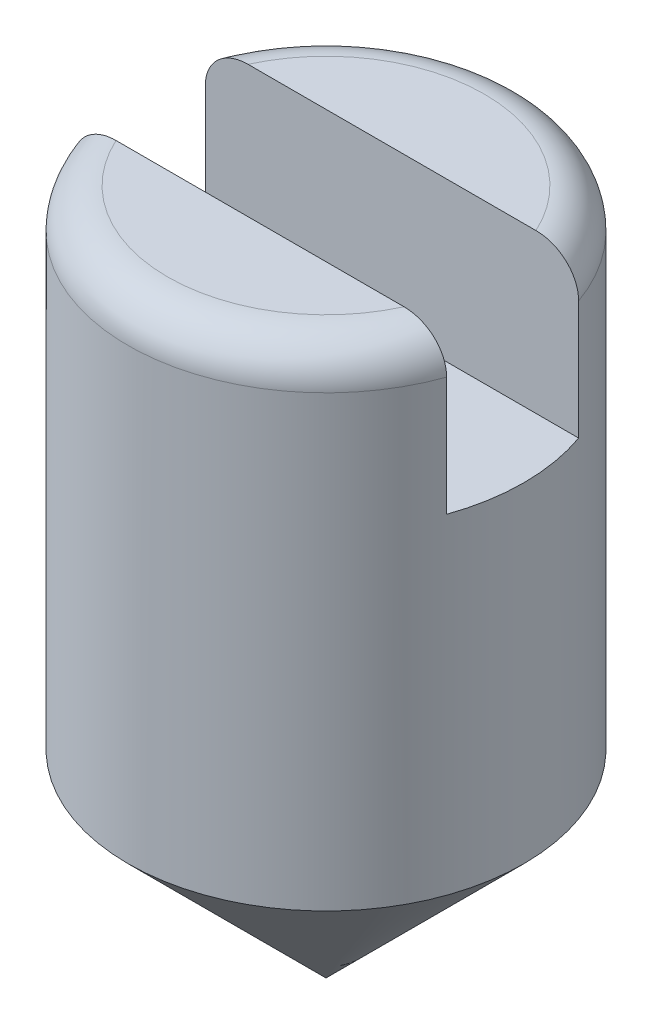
ISO-10303-21;
HEADER;
FILE_DESCRIPTION(('STEP AP214'),'2;1');
FILE_NAME('part.step','',(''),(''),'','','');
FILE_SCHEMA(('AUTOMOTIVE_DESIGN { 1 0 10303 214 1 1 1 1 }'));
ENDSEC;
DATA;
#1=APPLICATION_CONTEXT('core data for automotive mechanical design processes');
#2=APPLICATION_PROTOCOL_DEFINITION('international standard','automotive_design',2000,#1);
#3=PRODUCT_CONTEXT('',#1,'mechanical');
#4=PRODUCT('Part','Part','',(#3));
#5=PRODUCT_RELATED_PRODUCT_CATEGORY('part','',(#4));
#6=PRODUCT_DEFINITION_FORMATION('','',#4);
#7=PRODUCT_DEFINITION_CONTEXT('part definition',#1,'design');
#8=PRODUCT_DEFINITION('design','',#6,#7);
#9=PRODUCT_DEFINITION_SHAPE('','',#8);
#10=(LENGTH_UNIT() NAMED_UNIT(*) SI_UNIT(.MILLI.,.METRE.));
#11=(NAMED_UNIT(*) PLANE_ANGLE_UNIT() SI_UNIT($,.RADIAN.));
#12=(NAMED_UNIT(*) SI_UNIT($,.STERADIAN.) SOLID_ANGLE_UNIT());
#13=UNCERTAINTY_MEASURE_WITH_UNIT(LENGTH_MEASURE(1.E-05),#10,'distance_accuracy_value','');
#14=(GEOMETRIC_REPRESENTATION_CONTEXT(3) GLOBAL_UNCERTAINTY_ASSIGNED_CONTEXT((#13)) GLOBAL_UNIT_ASSIGNED_CONTEXT((#10,
#11,#12)) REPRESENTATION_CONTEXT('',''));
#15=CARTESIAN_POINT('',(0.,0.,0.));
#16=DIRECTION('',(0.,0.,1.));
#17=DIRECTION('',(1.,0.,0.));
#18=AXIS2_PLACEMENT_3D('',#15,#16,#17);
#19=CARTESIAN_POINT('',(0.,5.2,0.));
#20=DIRECTION('',(0.,1.,0.));
#21=DIRECTION('',(0.,0.,1.));
#22=AXIS2_PLACEMENT_3D('',#19,#20,#21);
#23=PLANE('',#22);
#24=DIRECTION('',(1.,0.,0.));
#25=VECTOR('',#24,1.);
#26=CARTESIAN_POINT('',(0.,5.2,0.5));
#27=LINE('',#26,#25);
#28=CARTESIAN_POINT('',(-1.09087121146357,5.2,0.5));
#29=VERTEX_POINT('',#28);
#30=CARTESIAN_POINT('',(1.09087121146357,5.2,0.5));
#31=VERTEX_POINT('',#30);
#32=EDGE_CURVE('E119',#29,#31,#27,.T.);
#33=ORIENTED_EDGE('',*,*,#32,.F.);
#34=CARTESIAN_POINT('',(0.,5.2,0.));
#35=DIRECTION('',(0.,1.,0.));
#36=DIRECTION('',(0.,0.,1.));
#37=AXIS2_PLACEMENT_3D('',#34,#35,#36);
#38=CIRCLE('',#37,1.2);
#39=EDGE_CURVE('E158',#29,#31,#38,.T.);
#40=ORIENTED_EDGE('',*,*,#39,.T.);
#41=EDGE_LOOP('',(#33,#40));
#42=FACE_BOUND('',#41,.T.);
#43=ADVANCED_FACE('F32',(#42),#23,.T.);
#44=CARTESIAN_POINT('',(0.,5.2,0.));
#45=DIRECTION('',(0.,-1.,0.));
#46=DIRECTION('',(0.,0.,-1.));
#47=AXIS2_PLACEMENT_3D('',#44,#45,#46);
#48=CYLINDRICAL_SURFACE('',#47,1.5);
#49=DIRECTION('',(0.,-1.,0.));
#50=VECTOR('',#49,1.);
#51=CARTESIAN_POINT('',(-1.41421356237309,5.2,-0.5));
#52=LINE('',#51,#50);
#53=CARTESIAN_POINT('',(-1.41421356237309,4.,-0.5));
#54=VERTEX_POINT('',#53);
#55=CARTESIAN_POINT('',(-1.41421356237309,4.9,-0.5));
#56=VERTEX_POINT('',#55);
#57=EDGE_CURVE('E93',#54,#56,#52,.F.);
#58=ORIENTED_EDGE('',*,*,#57,.T.);
#59=CARTESIAN_POINT('',(0.,4.9,0.));
#60=DIRECTION('',(0.,1.,0.));
#61=DIRECTION('',(0.,0.,1.));
#62=AXIS2_PLACEMENT_3D('',#59,#60,#61);
#63=CIRCLE('',#62,1.5);
#64=CARTESIAN_POINT('',(1.41421356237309,4.9,-0.5));
#65=VERTEX_POINT('',#64);
#66=EDGE_CURVE('E160',#56,#65,#63,.F.);
#67=ORIENTED_EDGE('',*,*,#66,.T.);
#68=DIRECTION('',(0.,-1.,0.));
#69=VECTOR('',#68,1.);
#70=CARTESIAN_POINT('',(1.41421356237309,5.2,-0.5));
#71=LINE('',#70,#69);
#72=CARTESIAN_POINT('',(1.41421356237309,4.,-0.5));
#73=VERTEX_POINT('',#72);
#74=EDGE_CURVE('E103',#65,#73,#71,.T.);
#75=ORIENTED_EDGE('',*,*,#74,.T.);
#76=CARTESIAN_POINT('',(0.,4.,0.));
#77=DIRECTION('',(0.,-1.,0.));
#78=DIRECTION('',(0.,0.,-1.));
#79=AXIS2_PLACEMENT_3D('',#76,#77,#78);
#80=CIRCLE('',#79,1.5);
#81=CARTESIAN_POINT('',(1.41421356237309,4.,0.5));
#82=VERTEX_POINT('',#81);
#83=EDGE_CURVE('E113',#73,#82,#80,.T.);
#84=ORIENTED_EDGE('',*,*,#83,.T.);
#85=DIRECTION('',(0.,-1.,0.));
#86=VECTOR('',#85,1.);
#87=CARTESIAN_POINT('',(1.41421356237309,5.2,0.5));
#88=LINE('',#87,#86);
#89=CARTESIAN_POINT('',(1.41421356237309,4.9,0.5));
#90=VERTEX_POINT('',#89);
#91=EDGE_CURVE('E163',#82,#90,#88,.F.);
#92=ORIENTED_EDGE('',*,*,#91,.T.);
#93=CARTESIAN_POINT('',(0.,4.9,0.));
#94=DIRECTION('',(0.,1.,0.));
#95=DIRECTION('',(0.,0.,1.));
#96=AXIS2_PLACEMENT_3D('',#93,#94,#95);
#97=CIRCLE('',#96,1.5);
#98=CARTESIAN_POINT('',(-1.41421356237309,4.9,0.5));
#99=VERTEX_POINT('',#98);
#100=EDGE_CURVE('E161',#90,#99,#97,.F.);
#101=ORIENTED_EDGE('',*,*,#100,.T.);
#102=DIRECTION('',(0.,-1.,0.));
#103=VECTOR('',#102,1.);
#104=CARTESIAN_POINT('',(-1.41421356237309,5.2,0.5));
#105=LINE('',#104,#103);
#106=CARTESIAN_POINT('',(-1.41421356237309,4.,0.5));
#107=VERTEX_POINT('',#106);
#108=EDGE_CURVE('E118',#99,#107,#105,.T.);
#109=ORIENTED_EDGE('',*,*,#108,.T.);
#110=EDGE_CURVE('E110',#107,#54,#80,.T.);
#111=ORIENTED_EDGE('',*,*,#110,.T.);
#112=EDGE_LOOP('',(#58,#67,#75,#84,#92,#101,#109,#111));
#113=FACE_BOUND('',#112,.T.);
#114=CARTESIAN_POINT('',(0.,1.5,0.));
#115=DIRECTION('',(0.,1.,0.));
#116=DIRECTION('',(0.,0.,1.));
#117=AXIS2_PLACEMENT_3D('',#114,#115,#116);
#118=CIRCLE('',#117,1.5);
#119=CARTESIAN_POINT('',(0.,1.5,1.5));
#120=VERTEX_POINT('',#119);
#121=EDGE_CURVE('E164',#120,#120,#118,.T.);
#122=ORIENTED_EDGE('',*,*,#121,.T.);
#123=EDGE_LOOP('',(#122));
#124=FACE_BOUND('',#123,.T.);
#125=ADVANCED_FACE('F116',(#113,#124),#48,.T.);
#126=DIRECTION('',(-1.,0.,0.));
#127=VECTOR('',#126,1.);
#128=CARTESIAN_POINT('',(0.,5.2,-0.5));
#129=LINE('',#128,#127);
#130=CARTESIAN_POINT('',(1.09087121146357,5.2,-0.5));
#131=VERTEX_POINT('',#130);
#132=CARTESIAN_POINT('',(-1.09087121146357,5.2,-0.5));
#133=VERTEX_POINT('',#132);
#134=EDGE_CURVE('E122',#131,#133,#129,.T.);
#135=ORIENTED_EDGE('',*,*,#134,.F.);
#136=CARTESIAN_POINT('',(0.,5.2,0.));
#137=DIRECTION('',(0.,1.,0.));
#138=DIRECTION('',(0.,0.,1.));
#139=AXIS2_PLACEMENT_3D('',#136,#137,#138);
#140=CIRCLE('',#139,1.2);
#141=EDGE_CURVE('E121',#131,#133,#140,.T.);
#142=ORIENTED_EDGE('',*,*,#141,.T.);
#143=EDGE_LOOP('',(#135,#142));
#144=FACE_BOUND('',#143,.T.);
#145=ADVANCED_FACE('F151',(#144),#23,.T.);
#146=CARTESIAN_POINT('',(0.,1.5,0.));
#147=DIRECTION('',(0.,1.,0.));
#148=DIRECTION('',(0.,0.,1.));
#149=AXIS2_PLACEMENT_3D('',#146,#147,#148);
#150=CONICAL_SURFACE('',#149,1.5,0.78539816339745);
#151=CARTESIAN_POINT('',(0.,0.,0.));
#152=VERTEX_POINT('',#151);
#153=VERTEX_LOOP('',#152);
#154=FACE_BOUND('',#153,.T.);
#155=ORIENTED_EDGE('',*,*,#121,.F.);
#156=EDGE_LOOP('',(#155));
#157=FACE_BOUND('',#156,.T.);
#158=ADVANCED_FACE('F147',(#154,#157),#150,.T.);
#159=CARTESIAN_POINT('',(-2.6,4.,0.5));
#160=DIRECTION('',(0.,-1.,0.));
#161=DIRECTION('',(0.,0.,-1.));
#162=AXIS2_PLACEMENT_3D('',#159,#160,#161);
#163=PLANE('',#162);
#164=DIRECTION('',(1.,0.,0.));
#165=VECTOR('',#164,1.);
#166=CARTESIAN_POINT('',(-2.6,4.,-0.5));
#167=LINE('',#166,#165);
#168=EDGE_CURVE('E98',#54,#73,#167,.T.);
#169=ORIENTED_EDGE('',*,*,#168,.F.);
#170=ORIENTED_EDGE('',*,*,#110,.F.);
#171=DIRECTION('',(1.,0.,0.));
#172=VECTOR('',#171,1.);
#173=CARTESIAN_POINT('',(-2.6,4.,0.5));
#174=LINE('',#173,#172);
#175=EDGE_CURVE('E114',#107,#82,#174,.T.);
#176=ORIENTED_EDGE('',*,*,#175,.T.);
#177=ORIENTED_EDGE('',*,*,#83,.F.);
#178=EDGE_LOOP('',(#169,#170,#176,#177));
#179=FACE_BOUND('',#178,.T.);
#180=ADVANCED_FACE('F108',(#179),#163,.F.);
#181=CARTESIAN_POINT('',(-2.6,4.,0.5));
#182=DIRECTION('',(0.,0.,1.));
#183=DIRECTION('',(1.,0.,0.));
#184=AXIS2_PLACEMENT_3D('',#181,#182,#183);
#185=PLANE('',#184);
#186=ORIENTED_EDGE('',*,*,#32,.T.);
#187=CARTESIAN_POINT('',(1.09087121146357,5.2,0.5));
#188=CARTESIAN_POINT('',(1.11031747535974,5.20001313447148,0.5));
#189=CARTESIAN_POINT('',(1.12978116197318,5.19843756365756,0.5));
#190=CARTESIAN_POINT('',(1.16823476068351,5.19209472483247,0.5));
#191=CARTESIAN_POINT('',(1.18722319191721,5.18731852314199,0.5));
#192=CARTESIAN_POINT('',(1.22414551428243,5.17454503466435,0.5));
#193=CARTESIAN_POINT('',(1.24207683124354,5.16654022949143,0.5));
#194=CARTESIAN_POINT('',(1.27618956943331,5.14744254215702,0.5));
#195=CARTESIAN_POINT('',(1.29237347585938,5.13635412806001,0.5));
#196=CARTESIAN_POINT('',(1.32143076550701,5.11213937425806,0.5));
#197=CARTESIAN_POINT('',(1.33444911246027,5.0991871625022,0.5));
#198=CARTESIAN_POINT('',(1.35792759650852,5.07112682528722,0.5));
#199=CARTESIAN_POINT('',(1.36838751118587,5.05601851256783,0.5));
#200=CARTESIAN_POINT('',(1.38566927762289,5.02525442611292,0.5));
#201=CARTESIAN_POINT('',(1.39269678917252,5.00971379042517,0.5));
#202=CARTESIAN_POINT('',(1.40388722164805,4.97764531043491,0.5));
#203=CARTESIAN_POINT('',(1.40805467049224,4.96111907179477,0.5));
#204=CARTESIAN_POINT('',(1.41187869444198,4.93703122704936,0.5));
#205=CARTESIAN_POINT('',(1.41275420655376,4.92964617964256,0.5));
#206=CARTESIAN_POINT('',(1.41392106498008,4.91484202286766,0.5));
#207=CARTESIAN_POINT('',(1.41421334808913,4.90742298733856,0.5));
#208=CARTESIAN_POINT('',(1.41421356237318,4.90000000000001,0.5));
#209=B_SPLINE_CURVE_WITH_KNOTS('',3,(#187,#188,#189,#190,#191,#192,#193,#194,#195,#196,#197,
#198,#199,#200,#201,#202,#203,#204,#205,#206,#207,#208),.UNSPECIFIED.,.F.,.F.,(4,2,2,2,2,2,2,2,
2,2,4),(0.,0.0583019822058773,0.116767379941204,0.175369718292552,0.233887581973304,
0.288689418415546,0.343496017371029,0.394409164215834,0.445241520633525,0.467532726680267,
0.489788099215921),.UNSPECIFIED.);
#210=EDGE_CURVE('E11',#31,#90,#209,.T.);
#211=ORIENTED_EDGE('',*,*,#210,.T.);
#212=ORIENTED_EDGE('',*,*,#91,.F.);
#213=ORIENTED_EDGE('',*,*,#175,.F.);
#214=ORIENTED_EDGE('',*,*,#108,.F.);
#215=CARTESIAN_POINT('',(-1.41421356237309,4.9,0.5));
#216=CARTESIAN_POINT('',(-1.41423099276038,4.9161382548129,0.5));
#217=CARTESIAN_POINT('',(-1.41283355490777,4.93226771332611,0.5));
#218=CARTESIAN_POINT('',(-1.40734290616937,4.96402645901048,0.5));
#219=CARTESIAN_POINT('',(-1.40325554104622,4.97965675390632,0.5));
#220=CARTESIAN_POINT('',(-1.39251783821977,5.01000871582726,0.5));
#221=CARTESIAN_POINT('',(-1.38586744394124,5.02473036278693,0.5));
#222=CARTESIAN_POINT('',(-1.37023816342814,5.05288048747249,0.5));
#223=CARTESIAN_POINT('',(-1.36125878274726,5.06630868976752,0.5));
#224=CARTESIAN_POINT('',(-1.34105699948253,5.09180678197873,0.5));
#225=CARTESIAN_POINT('',(-1.32979231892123,5.10384311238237,0.5));
#226=CARTESIAN_POINT('',(-1.30549536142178,5.1259697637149,0.5));
#227=CARTESIAN_POINT('',(-1.2924628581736,5.1360598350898,0.5));
#228=CARTESIAN_POINT('',(-1.26426157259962,5.15460046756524,0.5));
#229=CARTESIAN_POINT('',(-1.2490154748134,5.16293322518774,0.5));
#230=CARTESIAN_POINT('',(-1.21740218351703,5.17711651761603,0.5));
#231=CARTESIAN_POINT('',(-1.20103425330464,5.18296540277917,0.5));
#232=CARTESIAN_POINT('',(-1.16910646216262,5.19171583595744,0.5));
#233=CARTESIAN_POINT('',(-1.15360507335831,5.19483403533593,0.5));
#234=CARTESIAN_POINT('',(-1.12235728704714,5.1989762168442,0.5));
#235=CARTESIAN_POINT('',(-1.10661147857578,5.20000462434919,0.5));
#236=CARTESIAN_POINT('',(-1.09087121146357,5.2,0.5));
#237=B_SPLINE_CURVE_WITH_KNOTS('',3,(#215,#216,#217,#218,#219,#220,#221,#222,#223,#224,#225,
#226,#227,#228,#229,#230,#231,#232,#233,#234,#235,#236),.UNSPECIFIED.,.F.,.F.,(4,2,2,2,2,2,2,2,
2,2,4),(0.,0.0483409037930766,0.0965770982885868,0.144814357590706,0.193061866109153,
0.242300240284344,0.291544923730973,0.343446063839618,0.395381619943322,0.442676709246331,
0.48987154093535),.UNSPECIFIED.);
#238=EDGE_CURVE('E45',#99,#29,#237,.T.);
#239=ORIENTED_EDGE('',*,*,#238,.T.);
#240=EDGE_LOOP('',(#186,#211,#212,#213,#214,#239));
#241=FACE_BOUND('',#240,.T.);
#242=ADVANCED_FACE('F144',(#241),#185,.F.);
#243=CARTESIAN_POINT('',(-2.6,4.,-0.5));
#244=DIRECTION('',(0.,0.,-1.));
#245=DIRECTION('',(-1.,0.,0.));
#246=AXIS2_PLACEMENT_3D('',#243,#244,#245);
#247=PLANE('',#246);
#248=ORIENTED_EDGE('',*,*,#134,.T.);
#249=CARTESIAN_POINT('',(-1.09087121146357,5.2,-0.5));
#250=CARTESIAN_POINT('',(-1.11031747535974,5.20001313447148,-0.5));
#251=CARTESIAN_POINT('',(-1.12978116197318,5.19843756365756,-0.5));
#252=CARTESIAN_POINT('',(-1.16823476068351,5.19209472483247,-0.5));
#253=CARTESIAN_POINT('',(-1.18722319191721,5.18731852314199,-0.5));
#254=CARTESIAN_POINT('',(-1.22414551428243,5.17454503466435,-0.5));
#255=CARTESIAN_POINT('',(-1.24207683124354,5.16654022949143,-0.5));
#256=CARTESIAN_POINT('',(-1.27618956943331,5.14744254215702,-0.5));
#257=CARTESIAN_POINT('',(-1.29237347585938,5.13635412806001,-0.5));
#258=CARTESIAN_POINT('',(-1.32143076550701,5.11213937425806,-0.5));
#259=CARTESIAN_POINT('',(-1.33444911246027,5.0991871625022,-0.5));
#260=CARTESIAN_POINT('',(-1.35792759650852,5.07112682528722,-0.5));
#261=CARTESIAN_POINT('',(-1.36838751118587,5.05601851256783,-0.5));
#262=CARTESIAN_POINT('',(-1.38566927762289,5.02525442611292,-0.5));
#263=CARTESIAN_POINT('',(-1.39269678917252,5.00971379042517,-0.5));
#264=CARTESIAN_POINT('',(-1.40388722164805,4.97764531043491,-0.5));
#265=CARTESIAN_POINT('',(-1.40805467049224,4.96111907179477,-0.5));
#266=CARTESIAN_POINT('',(-1.41187869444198,4.93703122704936,-0.5));
#267=CARTESIAN_POINT('',(-1.41275420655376,4.92964617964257,-0.5));
#268=CARTESIAN_POINT('',(-1.41392106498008,4.91484202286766,-0.5));
#269=CARTESIAN_POINT('',(-1.41421334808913,4.90742298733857,-0.5));
#270=CARTESIAN_POINT('',(-1.41421356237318,4.90000000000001,-0.5));
#271=B_SPLINE_CURVE_WITH_KNOTS('',3,(#249,#250,#251,#252,#253,#254,#255,#256,#257,#258,#259,
#260,#261,#262,#263,#264,#265,#266,#267,#268,#269,#270),.UNSPECIFIED.,.F.,.F.,(4,2,2,2,2,2,2,2,
2,2,4),(0.,0.0583019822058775,0.116767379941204,0.175369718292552,0.233887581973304,
0.288689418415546,0.34349601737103,0.394409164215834,0.445241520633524,0.467532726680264,
0.48978809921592),.UNSPECIFIED.);
#272=EDGE_CURVE('E99',#133,#56,#271,.T.);
#273=ORIENTED_EDGE('',*,*,#272,.T.);
#274=ORIENTED_EDGE('',*,*,#57,.F.);
#275=ORIENTED_EDGE('',*,*,#168,.T.);
#276=ORIENTED_EDGE('',*,*,#74,.F.);
#277=CARTESIAN_POINT('',(1.41421356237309,4.9,-0.5));
#278=CARTESIAN_POINT('',(1.41423099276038,4.9161382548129,-0.5));
#279=CARTESIAN_POINT('',(1.41283355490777,4.93226771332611,-0.5));
#280=CARTESIAN_POINT('',(1.40734290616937,4.96402645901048,-0.5));
#281=CARTESIAN_POINT('',(1.40325554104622,4.97965675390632,-0.5));
#282=CARTESIAN_POINT('',(1.39251783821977,5.01000871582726,-0.5));
#283=CARTESIAN_POINT('',(1.38586744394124,5.02473036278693,-0.5));
#284=CARTESIAN_POINT('',(1.37023816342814,5.05288048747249,-0.5));
#285=CARTESIAN_POINT('',(1.36125878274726,5.06630868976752,-0.5));
#286=CARTESIAN_POINT('',(1.34105699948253,5.09180678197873,-0.5));
#287=CARTESIAN_POINT('',(1.32979231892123,5.10384311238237,-0.5));
#288=CARTESIAN_POINT('',(1.30549536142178,5.1259697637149,-0.5));
#289=CARTESIAN_POINT('',(1.2924628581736,5.1360598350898,-0.5));
#290=CARTESIAN_POINT('',(1.26426157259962,5.15460046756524,-0.5));
#291=CARTESIAN_POINT('',(1.2490154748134,5.16293322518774,-0.5));
#292=CARTESIAN_POINT('',(1.21740218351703,5.17711651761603,-0.5));
#293=CARTESIAN_POINT('',(1.20103425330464,5.18296540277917,-0.5));
#294=CARTESIAN_POINT('',(1.16910646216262,5.19171583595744,-0.5));
#295=CARTESIAN_POINT('',(1.15360507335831,5.19483403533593,-0.5));
#296=CARTESIAN_POINT('',(1.12235728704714,5.1989762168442,-0.5));
#297=CARTESIAN_POINT('',(1.10661147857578,5.20000462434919,-0.5));
#298=CARTESIAN_POINT('',(1.09087121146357,5.2,-0.5));
#299=B_SPLINE_CURVE_WITH_KNOTS('',3,(#277,#278,#279,#280,#281,#282,#283,#284,#285,#286,#287,
#288,#289,#290,#291,#292,#293,#294,#295,#296,#297,#298),.UNSPECIFIED.,.F.,.F.,(4,2,2,2,2,2,2,2,
2,2,4),(0.,0.0483409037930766,0.0965770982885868,0.144814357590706,0.193061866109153,
0.242300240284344,0.291544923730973,0.343446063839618,0.395381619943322,0.442676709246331,
0.48987154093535),.UNSPECIFIED.);
#300=EDGE_CURVE('E128',#65,#131,#299,.T.);
#301=ORIENTED_EDGE('',*,*,#300,.T.);
#302=EDGE_LOOP('',(#248,#273,#274,#275,#276,#301));
#303=FACE_BOUND('',#302,.T.);
#304=ADVANCED_FACE('F96',(#303),#247,.F.);
#305=CARTESIAN_POINT('',(0.,4.9,0.));
#306=DIRECTION('',(0.,1.,0.));
#307=DIRECTION('',(0.,0.,1.));
#308=AXIS2_PLACEMENT_3D('',#305,#306,#307);
#309=TOROIDAL_SURFACE('',#308,1.2,0.3);
#310=ORIENTED_EDGE('',*,*,#300,.F.);
#311=ORIENTED_EDGE('',*,*,#66,.F.);
#312=ORIENTED_EDGE('',*,*,#272,.F.);
#313=ORIENTED_EDGE('',*,*,#141,.F.);
#314=EDGE_LOOP('',(#310,#311,#312,#313));
#315=FACE_BOUND('',#314,.T.);
#316=ADVANCED_FACE('F138',(#315),#309,.T.);
#317=CARTESIAN_POINT('',(0.,4.9,0.));
#318=DIRECTION('',(0.,1.,0.));
#319=DIRECTION('',(0.,0.,1.));
#320=AXIS2_PLACEMENT_3D('',#317,#318,#319);
#321=TOROIDAL_SURFACE('',#320,1.2,0.3);
#322=ORIENTED_EDGE('',*,*,#238,.F.);
#323=ORIENTED_EDGE('',*,*,#100,.F.);
#324=ORIENTED_EDGE('',*,*,#210,.F.);
#325=ORIENTED_EDGE('',*,*,#39,.F.);
#326=EDGE_LOOP('',(#322,#323,#324,#325));
#327=FACE_BOUND('',#326,.T.);
#328=ADVANCED_FACE('F34',(#327),#321,.T.);
#329=CLOSED_SHELL('',(#43,#125,#145,#158,#180,#242,#304,#316,#328));
#330=MANIFOLD_SOLID_BREP('B2',#329);
#331=ADVANCED_BREP_SHAPE_REPRESENTATION('',(#18,#330),#14);
#332=SHAPE_DEFINITION_REPRESENTATION(#9,#331);
ENDSEC;
END-ISO-10303-21;
